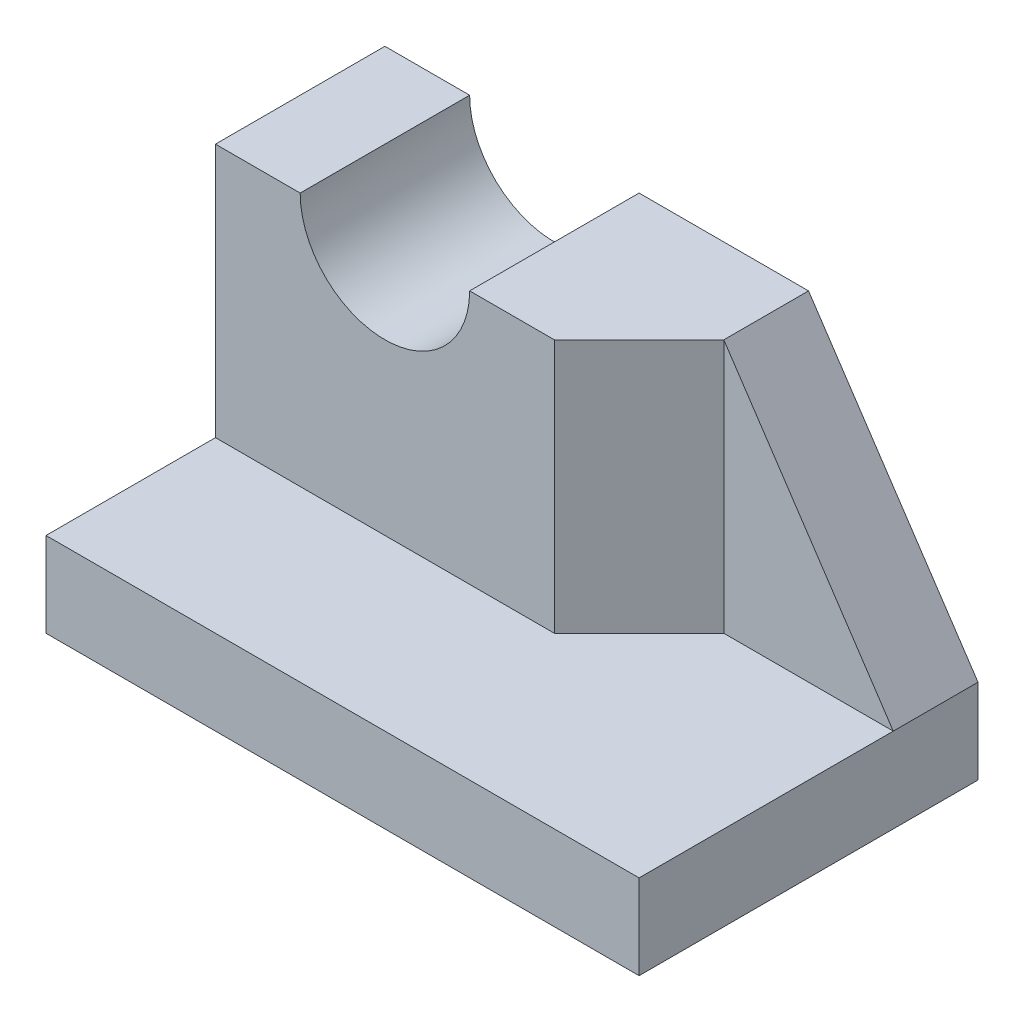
from build123d import *

# Parameters (mm, degrees)
SKETCH2_W      = 70
SKETCH2_H      = 40
EXTRUDE1_DEPTH = 10
EXTRUDE2_DEPTH = 30
SKETCH4_R      = 10
EXTRUDE3_DEPTH = 30
RIB1_REACH     = 68.521
SKETCH5_WALL_W = 171.096859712
SKETCH5_WALL_H = 10


with BuildPart() as part:
    # Sketch2 → Extrude1 (new body)
    with BuildSketch(Plane(origin=(0, 0, 0), x_dir=(1, 0, 0), z_dir=(0, 1, 0))):
        Rectangle(SKETCH2_W, SKETCH2_H)
    extrude(amount=EXTRUDE1_DEPTH)

    # Sketch3 → Extrude2 (add)
    with BuildSketch(Plane(origin=(0, 10, 0), x_dir=(1, 0, 0), z_dir=(0, 1, 0))):
        Polygon((-35, 0), (5, 0), (15, 10), (15, 20), (-35, 20), align=None)
    extrude(amount=EXTRUDE2_DEPTH)

    # Sketch4 → Extrude3 (cut)
    with BuildSketch(Plane.XY):
        with Locations((-15, 40)):
            Circle(SKETCH4_R)
    extrude(amount=-EXTRUDE3_DEPTH, mode=Mode.SUBTRACT)

    # Sketch5 wall → Rib1 (add, up to next)
    with BuildSketch(Plane(origin=(25, 25, -20), x_dir=(0.554700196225, -0.832050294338, 0), z_dir=(-0.832050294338, -0.554700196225, 0)), mode=Mode.PRIVATE) as rib1_sk1:
        with Locations((0, 5)):
            Rectangle(SKETCH5_WALL_W, SKETCH5_WALL_H)
    rib1_tool1 = extrude(rib1_sk1.sketch, amount=RIB1_REACH, mode=Mode.PRIVATE) - part.part
    add(rib1_tool1.solids().sort_by_distance((25, 25, -20))[0])


solid = part.part
